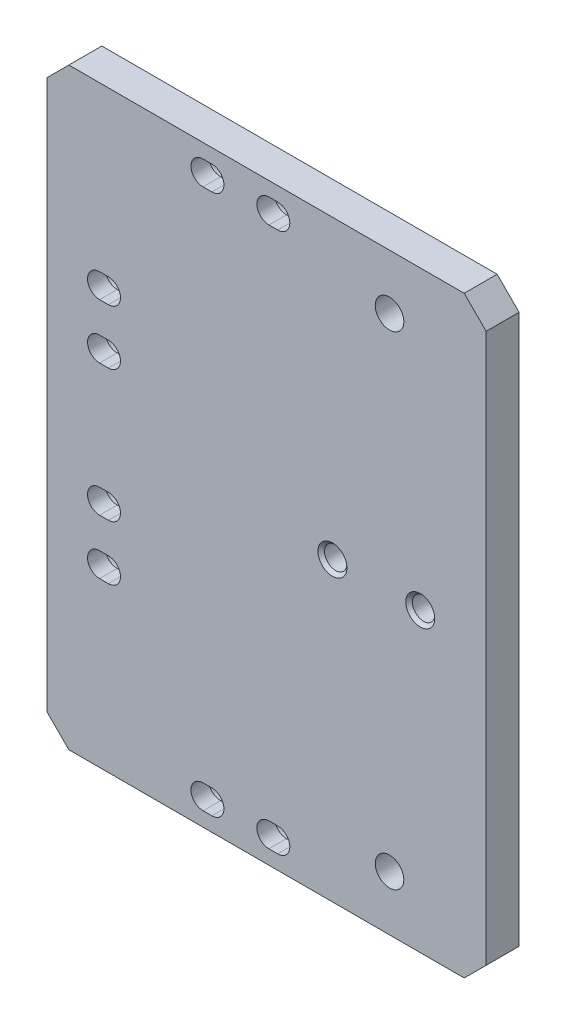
from build123d import *

# Parameters (mm, degrees)
BASE_EXTRUSION_DEPTH                               = 15
CHAMBRAGE_POUR_VIS_T_TE_RONDE_BOMB_E_M_D           = 11
CHAMBRAGE_POUR_VIS_T_TE_RONDE_BOMB_E_M_CBORE_D     = 17
CHAMBRAGE_POUR_VIS_T_TE_RONDE_BOMB_E_M_CBORE_DEPTH = 7
CHANFREIN1_SIZE                                    = 10
ESQUISSE4_R                                        = 6.5
EXTRUSION1_DEPTH                                   = 337.340601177
TROU_TARAUD_M121_D                                 = 10.2
CHANFREIN2_SIZE                                    = 1.5
ENL_V_MAT_EXTRU_1_DEPTH                            = 337.340601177
ENL_V_MAT_EXTRU_2_DEPTH                            = 7


with BuildPart() as part:
    # Esquisse1 → Base-Extrusion (new body)
    with BuildSketch(Plane.XY):
        Polygon((0, 0), (190, 0), (200, 10), (200, 260), (190, 270), (0, 270), align=None)
    extrude(amount=BASE_EXTRUSION_DEPTH)

    # Chambrage pour vis _ t_te ronde bomb_e M (through all)
    with Locations(Plane(origin=(0, 0, 0), x_dir=(-1, 0, 0), z_dir=(0, 0, -1))):
        with Locations((-26, 165), (-26, 105), (-26, 190), (-26, 80), (-73.1, 258), (-103.1, 258), (-103.1, 12), (-73.1, 12)):
            CounterBoreHole(CHAMBRAGE_POUR_VIS_T_TE_RONDE_BOMB_E_M_D / 2, CHAMBRAGE_POUR_VIS_T_TE_RONDE_BOMB_E_M_CBORE_D / 2, CHAMBRAGE_POUR_VIS_T_TE_RONDE_BOMB_E_M_CBORE_DEPTH)

    # Chanfrein1
    chanfrein1_edges = [part.edges().sort_by_distance(p)[0] for p in [
        (0, 270, 7.5),
        (0, 0, 7.5),
    ]]
    chamfer(chanfrein1_edges, length=CHANFREIN1_SIZE)

    # Esquisse4 → Extrusion1 (cut, through all)
    with BuildSketch(Plane(origin=(0, 0, 0), x_dir=(-1, 0, 0), z_dir=(0, 0, -1))):
        with Locations((-156, 245)):
            Circle(ESQUISSE4_R)
        with Locations(Location((-156, 25, 0), (0, 0, 180))):
            Circle(ESQUISSE4_R)
    extrude(amount=-EXTRUSION1_DEPTH, mode=Mode.SUBTRACT)

    # Trou taraud_ M121 (through all)
    with Locations(Plane(origin=(0, 0, 0), x_dir=(-1, 0, 0), z_dir=(0, 0, -1))):
        with Locations((-130, 135), (-170, 135)):
            Hole(TROU_TARAUD_M121_D / 2)

    # Chanfrein2
    chanfrein2_edges = [part.edges().sort_by_distance(p)[0] for p in [
        (124.9, 135, 0),
        (124.9, 135, 15),
        (164.9, 135, 0),
        (164.9, 135, 15),
    ]]
    chamfer(chanfrein2_edges, length=CHANFREIN2_SIZE)

    # Esquisse7 → Enl_v. mat.-Extru.1 (cut, through all)
    with BuildSketch(Plane(origin=(0, 0, 0), x_dir=(-1, 0, 0), z_dir=(0, 0, -1))):
        with BuildLine():
            Line((-101.1, 263.5), (-105.1, 263.5))
            ThreePointArc((-105.1, 263.5), (-110.6, 258), (-105.1, 252.5))
            Line((-105.1, 252.5), (-101.1, 252.5))
            ThreePointArc((-101.1, 252.5), (-95.6, 258), (-101.1, 263.5))
        make_face()
        with BuildLine():
            Line((-71.1, 263.5), (-75.1, 263.5))
            ThreePointArc((-75.1, 263.5), (-80.6, 258), (-75.1, 252.5))
            Line((-75.1, 252.5), (-71.1, 252.5))
            ThreePointArc((-71.1, 252.5), (-65.6, 258), (-71.1, 263.5))
        make_face()
        with BuildLine():
            Line((-71.1, 17.5), (-75.1, 17.5))
            ThreePointArc((-75.1, 17.5), (-80.6, 12), (-75.1, 6.5))
            Line((-75.1, 6.5), (-71.1, 6.5))
            ThreePointArc((-71.1, 6.5), (-65.6, 12), (-71.1, 17.5))
        make_face()
        with BuildLine():
            Line((-101.1, 17.5), (-105.1, 17.5))
            ThreePointArc((-105.1, 17.5), (-110.6, 12), (-105.1, 6.5))
            Line((-105.1, 6.5), (-101.1, 6.5))
            ThreePointArc((-101.1, 6.5), (-95.6, 12), (-101.1, 17.5))
        make_face()
        with BuildLine():
            Line((-28, 195.5), (-24, 195.5))
            ThreePointArc((-24, 195.5), (-18.5, 190), (-24, 184.5))
            Line((-24, 184.5), (-28, 184.5))
            ThreePointArc((-28, 184.5), (-33.5, 190), (-28, 195.5))
        make_face()
        with BuildLine():
            Line((-28, 170.5), (-24, 170.5))
            ThreePointArc((-24, 170.5), (-18.5, 165), (-24, 159.5))
            Line((-24, 159.5), (-28, 159.5))
            ThreePointArc((-28, 159.5), (-33.5, 165), (-28, 170.5))
        make_face()
        with BuildLine():
            Line((-28, 110.5), (-24, 110.5))
            ThreePointArc((-24, 110.5), (-18.5, 105), (-24, 99.5))
            Line((-24, 99.5), (-28, 99.5))
            ThreePointArc((-28, 99.5), (-33.5, 105), (-28, 110.5))
        make_face()
        with BuildLine():
            Line((-28, 85.5), (-24, 85.5))
            ThreePointArc((-24, 85.5), (-18.5, 80), (-24, 74.5))
            Line((-24, 74.5), (-28, 74.5))
            ThreePointArc((-28, 74.5), (-33.5, 80), (-28, 85.5))
        make_face()
    extrude(amount=-ENL_V_MAT_EXTRU_1_DEPTH, mode=Mode.SUBTRACT)

    # Esquisse8 → Enl_v. mat.-Extru.2 (cut)
    with BuildSketch(Plane(origin=(0, 0, 0), x_dir=(-1, 0, 0), z_dir=(0, 0, -1))):
        with BuildLine():
            Line((-71.1, 266.5), (-75.1, 266.5))
            ThreePointArc((-75.1, 266.5), (-83.6, 258), (-75.1, 249.5))
            Line((-75.1, 249.5), (-71.1, 249.5))
            ThreePointArc((-71.1, 249.5), (-62.6, 258), (-71.1, 266.5))
        make_face()
        with BuildLine():
            Line((-101.1, 266.5), (-105.1, 266.5))
            ThreePointArc((-105.1, 266.5), (-113.6, 258), (-105.1, 249.5))
            Line((-105.1, 249.5), (-101.1, 249.5))
            ThreePointArc((-101.1, 249.5), (-92.6, 258), (-101.1, 266.5))
        make_face()
        with BuildLine():
            Line((-71.1, 3.5), (-75.1, 3.5))
            ThreePointArc((-75.1, 3.5), (-83.6, 12), (-75.1, 20.5))
            Line((-75.1, 20.5), (-71.1, 20.5))
            ThreePointArc((-71.1, 20.5), (-62.6, 12), (-71.1, 3.5))
        make_face()
        with BuildLine():
            Line((-101.1, 20.5), (-105.1, 20.5))
            ThreePointArc((-105.1, 20.5), (-113.6, 12), (-105.1, 3.5))
            Line((-105.1, 3.5), (-101.1, 3.5))
            ThreePointArc((-101.1, 3.5), (-92.6, 12), (-101.1, 20.5))
        make_face()
        with BuildLine():
            Line((-28, 198.5), (-24, 198.5))
            ThreePointArc((-24, 198.5), (-15.5, 190), (-24, 181.5))
            Line((-24, 181.5), (-28, 181.5))
            ThreePointArc((-28, 181.5), (-36.5, 190), (-28, 198.5))
        make_face()
        with BuildLine():
            Line((-28, 173.5), (-24, 173.5))
            ThreePointArc((-24, 173.5), (-15.5, 165), (-24, 156.5))
            Line((-24, 156.5), (-28, 156.5))
            ThreePointArc((-28, 156.5), (-36.5, 165), (-28, 173.5))
        make_face()
        with BuildLine():
            Line((-28, 113.5), (-24, 113.5))
            ThreePointArc((-24, 113.5), (-15.5, 105), (-24, 96.5))
            Line((-24, 96.5), (-28, 96.5))
            ThreePointArc((-28, 96.5), (-36.5, 105), (-28, 113.5))
        make_face()
        with BuildLine():
            Line((-28, 88.5), (-24, 88.5))
            ThreePointArc((-24, 88.5), (-15.5, 80), (-24, 71.5))
            Line((-24, 71.5), (-28, 71.5))
            ThreePointArc((-28, 71.5), (-36.5, 80), (-28, 88.5))
        make_face()
    extrude(amount=-ENL_V_MAT_EXTRU_2_DEPTH, mode=Mode.SUBTRACT)


solid = part.part
